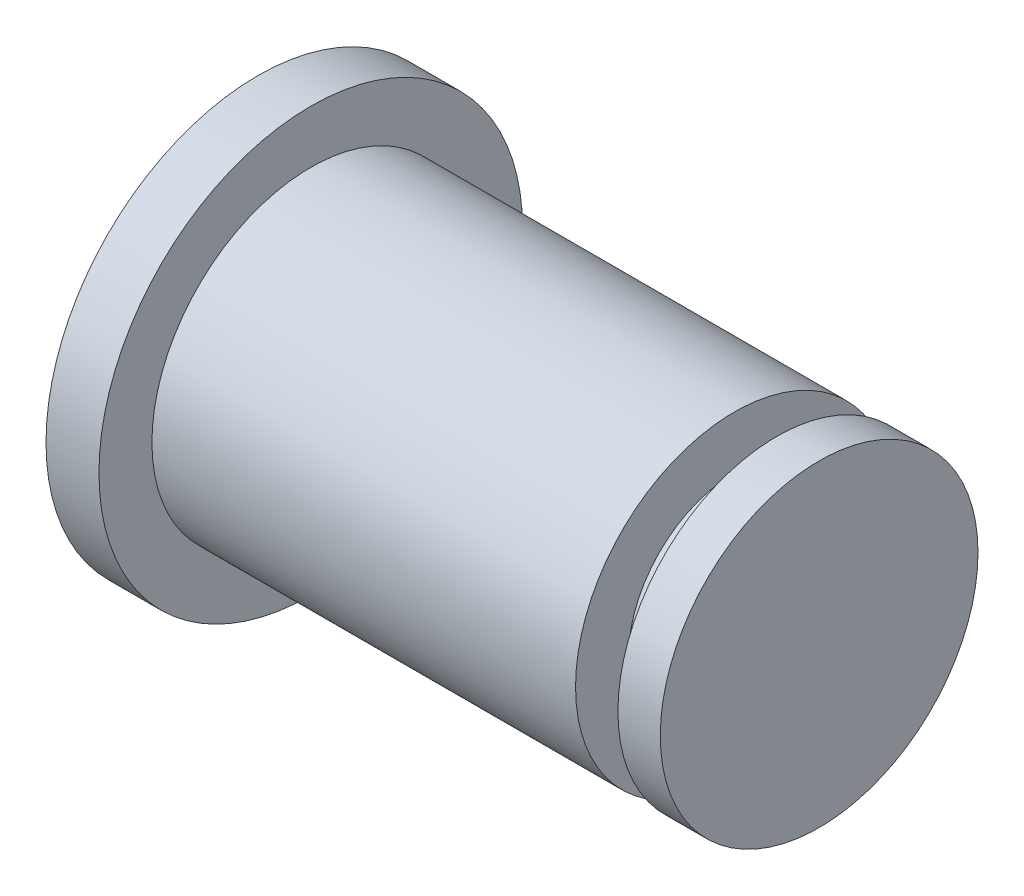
ISO-10303-21;
HEADER;
FILE_DESCRIPTION(('STEP AP214'),'2;1');
FILE_NAME('part.step','',(''),(''),'','','');
FILE_SCHEMA(('AUTOMOTIVE_DESIGN { 1 0 10303 214 1 1 1 1 }'));
ENDSEC;
DATA;
#1=APPLICATION_CONTEXT('core data for automotive mechanical design processes');
#2=APPLICATION_PROTOCOL_DEFINITION('international standard','automotive_design',2000,#1);
#3=PRODUCT_CONTEXT('',#1,'mechanical');
#4=PRODUCT('Part','Part','',(#3));
#5=PRODUCT_RELATED_PRODUCT_CATEGORY('part','',(#4));
#6=PRODUCT_DEFINITION_FORMATION('','',#4);
#7=PRODUCT_DEFINITION_CONTEXT('part definition',#1,'design');
#8=PRODUCT_DEFINITION('design','',#6,#7);
#9=PRODUCT_DEFINITION_SHAPE('','',#8);
#10=(LENGTH_UNIT() NAMED_UNIT(*) SI_UNIT(.MILLI.,.METRE.));
#11=(NAMED_UNIT(*) PLANE_ANGLE_UNIT() SI_UNIT($,.RADIAN.));
#12=(NAMED_UNIT(*) SI_UNIT($,.STERADIAN.) SOLID_ANGLE_UNIT());
#13=UNCERTAINTY_MEASURE_WITH_UNIT(LENGTH_MEASURE(1.E-05),#10,'distance_accuracy_value','');
#14=(GEOMETRIC_REPRESENTATION_CONTEXT(3) GLOBAL_UNCERTAINTY_ASSIGNED_CONTEXT((#13)) GLOBAL_UNIT_ASSIGNED_CONTEXT((#10,
#11,#12)) REPRESENTATION_CONTEXT('',''));
#15=CARTESIAN_POINT('',(0.,0.,0.));
#16=DIRECTION('',(0.,0.,1.));
#17=DIRECTION('',(1.,0.,0.));
#18=AXIS2_PLACEMENT_3D('',#15,#16,#17);
#19=CARTESIAN_POINT('',(0.,0.,0.));
#20=DIRECTION('',(1.,0.,0.));
#21=DIRECTION('',(0.,0.,-1.));
#22=AXIS2_PLACEMENT_3D('',#19,#20,#21);
#23=PLANE('',#22);
#24=CARTESIAN_POINT('',(0.,0.,0.));
#25=DIRECTION('',(-1.,0.,0.));
#26=DIRECTION('',(0.,0.,1.));
#27=AXIS2_PLACEMENT_3D('',#24,#25,#26);
#28=CIRCLE('',#27,4.);
#29=CARTESIAN_POINT('',(0.,0.,4.));
#30=VERTEX_POINT('',#29);
#31=EDGE_CURVE('E10',#30,#30,#28,.T.);
#32=ORIENTED_EDGE('',*,*,#31,.T.);
#33=EDGE_LOOP('',(#32));
#34=FACE_BOUND('',#33,.T.);
#35=ADVANCED_FACE('F346',(#34),#23,.F.);
#36=CARTESIAN_POINT('',(-44.7939970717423,0.,0.));
#37=DIRECTION('',(-1.,0.,0.));
#38=DIRECTION('',(0.,0.,1.));
#39=AXIS2_PLACEMENT_3D('',#36,#37,#38);
#40=CYLINDRICAL_SURFACE('',#39,4.);
#41=ORIENTED_EDGE('',*,*,#31,.F.);
#42=EDGE_LOOP('',(#41));
#43=FACE_BOUND('',#42,.T.);
#44=CARTESIAN_POINT('',(1.,0.,0.));
#45=DIRECTION('',(-1.,0.,0.));
#46=DIRECTION('',(0.,0.,1.));
#47=AXIS2_PLACEMENT_3D('',#44,#45,#46);
#48=CIRCLE('',#47,4.);
#49=CARTESIAN_POINT('',(1.,0.,4.));
#50=VERTEX_POINT('',#49);
#51=EDGE_CURVE('E352',#50,#50,#48,.T.);
#52=ORIENTED_EDGE('',*,*,#51,.T.);
#53=EDGE_LOOP('',(#52));
#54=FACE_BOUND('',#53,.T.);
#55=ADVANCED_FACE('F390',(#43,#54),#40,.T.);
#56=CARTESIAN_POINT('',(1.,4.,0.));
#57=DIRECTION('',(-1.,0.,0.));
#58=DIRECTION('',(0.,0.,1.));
#59=AXIS2_PLACEMENT_3D('',#56,#57,#58);
#60=PLANE('',#59);
#61=ORIENTED_EDGE('',*,*,#51,.F.);
#62=EDGE_LOOP('',(#61));
#63=FACE_BOUND('',#62,.T.);
#64=CARTESIAN_POINT('',(1.,0.,0.));
#65=DIRECTION('',(-1.,0.,0.));
#66=DIRECTION('',(0.,0.,1.));
#67=AXIS2_PLACEMENT_3D('',#64,#65,#66);
#68=CIRCLE('',#67,3.);
#69=CARTESIAN_POINT('',(1.,0.,3.));
#70=VERTEX_POINT('',#69);
#71=EDGE_CURVE('E356',#70,#70,#68,.T.);
#72=ORIENTED_EDGE('',*,*,#71,.T.);
#73=EDGE_LOOP('',(#72));
#74=FACE_BOUND('',#73,.T.);
#75=ADVANCED_FACE('F394',(#63,#74),#60,.F.);
#76=CARTESIAN_POINT('',(-44.7939970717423,0.,0.));
#77=DIRECTION('',(-1.,0.,0.));
#78=DIRECTION('',(0.,0.,1.));
#79=AXIS2_PLACEMENT_3D('',#76,#77,#78);
#80=CYLINDRICAL_SURFACE('',#79,3.);
#81=ORIENTED_EDGE('',*,*,#71,.F.);
#82=EDGE_LOOP('',(#81));
#83=FACE_BOUND('',#82,.T.);
#84=CARTESIAN_POINT('',(9.,0.,0.));
#85=DIRECTION('',(-1.,0.,0.));
#86=DIRECTION('',(0.,0.,1.));
#87=AXIS2_PLACEMENT_3D('',#84,#85,#86);
#88=CIRCLE('',#87,3.);
#89=CARTESIAN_POINT('',(9.,0.,3.));
#90=VERTEX_POINT('',#89);
#91=EDGE_CURVE('E360',#90,#90,#88,.T.);
#92=ORIENTED_EDGE('',*,*,#91,.T.);
#93=EDGE_LOOP('',(#92));
#94=FACE_BOUND('',#93,.T.);
#95=ADVANCED_FACE('F399',(#83,#94),#80,.T.);
#96=CARTESIAN_POINT('',(9.,3.,0.));
#97=DIRECTION('',(-1.,0.,0.));
#98=DIRECTION('',(0.,0.,1.));
#99=AXIS2_PLACEMENT_3D('',#96,#97,#98);
#100=PLANE('',#99);
#101=ORIENTED_EDGE('',*,*,#91,.F.);
#102=EDGE_LOOP('',(#101));
#103=FACE_BOUND('',#102,.T.);
#104=CARTESIAN_POINT('',(9.,0.,0.));
#105=DIRECTION('',(-1.,0.,0.));
#106=DIRECTION('',(0.,0.,1.));
#107=AXIS2_PLACEMENT_3D('',#104,#105,#106);
#108=CIRCLE('',#107,2.);
#109=CARTESIAN_POINT('',(9.,0.,2.));
#110=VERTEX_POINT('',#109);
#111=EDGE_CURVE('E365',#110,#110,#108,.T.);
#112=ORIENTED_EDGE('',*,*,#111,.T.);
#113=EDGE_LOOP('',(#112));
#114=FACE_BOUND('',#113,.T.);
#115=ADVANCED_FACE('F405',(#103,#114),#100,.F.);
#116=CARTESIAN_POINT('',(-44.7939970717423,0.,0.));
#117=DIRECTION('',(-1.,0.,0.));
#118=DIRECTION('',(0.,0.,1.));
#119=AXIS2_PLACEMENT_3D('',#116,#117,#118);
#120=CYLINDRICAL_SURFACE('',#119,2.);
#121=ORIENTED_EDGE('',*,*,#111,.F.);
#122=EDGE_LOOP('',(#121));
#123=FACE_BOUND('',#122,.T.);
#124=CARTESIAN_POINT('',(9.8,0.,0.));
#125=DIRECTION('',(-1.,0.,0.));
#126=DIRECTION('',(0.,0.,1.));
#127=AXIS2_PLACEMENT_3D('',#124,#125,#126);
#128=CIRCLE('',#127,2.);
#129=CARTESIAN_POINT('',(9.8,0.,2.));
#130=VERTEX_POINT('',#129);
#131=EDGE_CURVE('E368',#130,#130,#128,.T.);
#132=ORIENTED_EDGE('',*,*,#131,.T.);
#133=EDGE_LOOP('',(#132));
#134=FACE_BOUND('',#133,.T.);
#135=ADVANCED_FACE('F409',(#123,#134),#120,.T.);
#136=CARTESIAN_POINT('',(9.8,2.,0.));
#137=DIRECTION('',(1.,0.,0.));
#138=DIRECTION('',(0.,0.,-1.));
#139=AXIS2_PLACEMENT_3D('',#136,#137,#138);
#140=PLANE('',#139);
#141=ORIENTED_EDGE('',*,*,#131,.F.);
#142=EDGE_LOOP('',(#141));
#143=FACE_BOUND('',#142,.T.);
#144=CARTESIAN_POINT('',(9.8,0.,0.));
#145=DIRECTION('',(-1.,0.,0.));
#146=DIRECTION('',(0.,0.,1.));
#147=AXIS2_PLACEMENT_3D('',#144,#145,#146);
#148=CIRCLE('',#147,3.);
#149=CARTESIAN_POINT('',(9.8,0.,3.));
#150=VERTEX_POINT('',#149);
#151=EDGE_CURVE('E371',#150,#150,#148,.T.);
#152=ORIENTED_EDGE('',*,*,#151,.T.);
#153=EDGE_LOOP('',(#152));
#154=FACE_BOUND('',#153,.T.);
#155=ADVANCED_FACE('F386',(#143,#154),#140,.F.);
#156=CARTESIAN_POINT('',(-44.7939970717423,0.,0.));
#157=DIRECTION('',(-1.,0.,0.));
#158=DIRECTION('',(0.,0.,1.));
#159=AXIS2_PLACEMENT_3D('',#156,#157,#158);
#160=CYLINDRICAL_SURFACE('',#159,3.);
#161=ORIENTED_EDGE('',*,*,#151,.F.);
#162=EDGE_LOOP('',(#161));
#163=FACE_BOUND('',#162,.T.);
#164=CARTESIAN_POINT('',(10.6,0.,0.));
#165=DIRECTION('',(-1.,0.,0.));
#166=DIRECTION('',(0.,0.,1.));
#167=AXIS2_PLACEMENT_3D('',#164,#165,#166);
#168=CIRCLE('',#167,3.);
#169=CARTESIAN_POINT('',(10.6,0.,3.));
#170=VERTEX_POINT('',#169);
#171=EDGE_CURVE('E374',#170,#170,#168,.T.);
#172=ORIENTED_EDGE('',*,*,#171,.T.);
#173=EDGE_LOOP('',(#172));
#174=FACE_BOUND('',#173,.T.);
#175=ADVANCED_FACE('F378',(#163,#174),#160,.T.);
#176=CARTESIAN_POINT('',(10.6,3.,0.));
#177=DIRECTION('',(-1.,0.,0.));
#178=DIRECTION('',(0.,0.,1.));
#179=AXIS2_PLACEMENT_3D('',#176,#177,#178);
#180=PLANE('',#179);
#181=ORIENTED_EDGE('',*,*,#171,.F.);
#182=EDGE_LOOP('',(#181));
#183=FACE_BOUND('',#182,.T.);
#184=ADVANCED_FACE('F380',(#183),#180,.F.);
#185=CLOSED_SHELL('',(#35,#55,#75,#95,#115,#135,#155,#175,#184));
#186=MANIFOLD_SOLID_BREP('B2',#185);
#187=ADVANCED_BREP_SHAPE_REPRESENTATION('',(#18,#186),#14);
#188=SHAPE_DEFINITION_REPRESENTATION(#9,#187);
ENDSEC;
END-ISO-10303-21;
